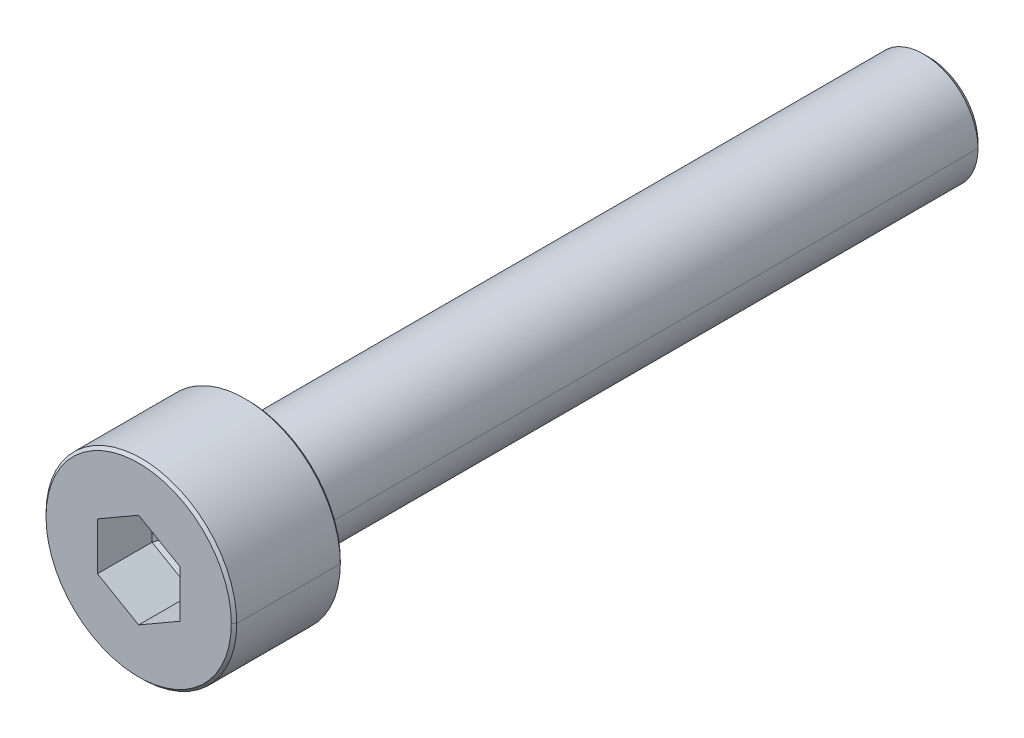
ISO-10303-21;
HEADER;
FILE_DESCRIPTION(('STEP AP214'),'2;1');
FILE_NAME('part.step','',(''),(''),'','','');
FILE_SCHEMA(('AUTOMOTIVE_DESIGN { 1 0 10303 214 1 1 1 1 }'));
ENDSEC;
DATA;
#1=APPLICATION_CONTEXT('core data for automotive mechanical design processes');
#2=APPLICATION_PROTOCOL_DEFINITION('international standard','automotive_design',2000,#1);
#3=PRODUCT_CONTEXT('',#1,'mechanical');
#4=PRODUCT('Part','Part','',(#3));
#5=PRODUCT_RELATED_PRODUCT_CATEGORY('part','',(#4));
#6=PRODUCT_DEFINITION_FORMATION('','',#4);
#7=PRODUCT_DEFINITION_CONTEXT('part definition',#1,'design');
#8=PRODUCT_DEFINITION('design','',#6,#7);
#9=PRODUCT_DEFINITION_SHAPE('','',#8);
#10=(LENGTH_UNIT() NAMED_UNIT(*) SI_UNIT(.MILLI.,.METRE.));
#11=(NAMED_UNIT(*) PLANE_ANGLE_UNIT() SI_UNIT($,.RADIAN.));
#12=(NAMED_UNIT(*) SI_UNIT($,.STERADIAN.) SOLID_ANGLE_UNIT());
#13=UNCERTAINTY_MEASURE_WITH_UNIT(LENGTH_MEASURE(1.E-05),#10,'distance_accuracy_value','');
#14=(GEOMETRIC_REPRESENTATION_CONTEXT(3) GLOBAL_UNCERTAINTY_ASSIGNED_CONTEXT((#13)) GLOBAL_UNIT_ASSIGNED_CONTEXT((#10,
#11,#12)) REPRESENTATION_CONTEXT('',''));
#15=CARTESIAN_POINT('',(0.,0.,0.));
#16=DIRECTION('',(0.,0.,1.));
#17=DIRECTION('',(1.,0.,0.));
#18=AXIS2_PLACEMENT_3D('',#15,#16,#17);
#19=CARTESIAN_POINT('',(0.,0.,25.));
#20=DIRECTION('',(0.,0.,1.));
#21=DIRECTION('',(1.,0.,0.));
#22=AXIS2_PLACEMENT_3D('',#19,#20,#21);
#23=CYLINDRICAL_SURFACE('',#22,3.5);
#24=DIRECTION('',(0.,0.,1.));
#25=VECTOR('',#24,1.);
#26=CARTESIAN_POINT('',(3.499997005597,1.366616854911E-09,25.1000029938));
#27=LINE('',#26,#25);
#28=CARTESIAN_POINT('',(3.5,0.,25.10000246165));
#29=VERTEX_POINT('',#28);
#30=CARTESIAN_POINT('',(3.5,0.,28.89999753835));
#31=VERTEX_POINT('',#30);
#32=EDGE_CURVE('E487',#29,#31,#27,.T.);
#33=ORIENTED_EDGE('',*,*,#32,.F.);
#34=CARTESIAN_POINT('',(0.,0.,25.10000246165));
#35=DIRECTION('',(0.,0.,-1.));
#36=DIRECTION('',(-1.,0.,0.));
#37=AXIS2_PLACEMENT_3D('',#34,#35,#36);
#38=CIRCLE('',#37,3.5);
#39=CARTESIAN_POINT('',(-3.5,0.,25.10000246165));
#40=VERTEX_POINT('',#39);
#41=EDGE_CURVE('E447',#40,#29,#38,.T.);
#42=ORIENTED_EDGE('',*,*,#41,.F.);
#43=DIRECTION('',(0.,0.,1.));
#44=VECTOR('',#43,1.);
#45=CARTESIAN_POINT('',(-3.499997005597,-1.366617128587E-09,25.1000029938));
#46=LINE('',#45,#44);
#47=CARTESIAN_POINT('',(-3.5,0.,28.89999753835));
#48=VERTEX_POINT('',#47);
#49=EDGE_CURVE('E233',#40,#48,#46,.T.);
#50=ORIENTED_EDGE('',*,*,#49,.T.);
#51=CARTESIAN_POINT('',(0.,0.,28.89999753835));
#52=DIRECTION('',(0.,0.,1.));
#53=DIRECTION('',(1.,0.,0.));
#54=AXIS2_PLACEMENT_3D('',#51,#52,#53);
#55=CIRCLE('',#54,3.5);
#56=EDGE_CURVE('E10',#31,#48,#55,.T.);
#57=ORIENTED_EDGE('',*,*,#56,.F.);
#58=EDGE_LOOP('',(#33,#42,#50,#57));
#59=FACE_BOUND('',#58,.T.);
#60=ADVANCED_FACE('F16',(#59),#23,.T.);
#61=CARTESIAN_POINT('',(0.,0.,28.94999384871));
#62=DIRECTION('',(0.,0.,-1.));
#63=DIRECTION('',(0.,-1.,0.));
#64=AXIS2_PLACEMENT_3D('',#61,#62,#63);
#65=CONICAL_SURFACE('',#64,3.449994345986,0.785396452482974);
#66=DIRECTION('',(0.707113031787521,-2.85301984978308E-09,-0.707100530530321));
#67=VECTOR('',#66,1.);
#68=CARTESIAN_POINT('',(3.399996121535,1.770094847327E-09,28.99999612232));
#69=LINE('',#68,#67);
#70=CARTESIAN_POINT('',(3.399993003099,0.,28.99999536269));
#71=VERTEX_POINT('',#70);
#72=EDGE_CURVE('E496',#71,#31,#69,.T.);
#73=ORIENTED_EDGE('',*,*,#72,.T.);
#74=ORIENTED_EDGE('',*,*,#56,.T.);
#75=DIRECTION('',(-0.707113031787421,2.85301614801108E-09,-0.707100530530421));
#76=VECTOR('',#75,1.);
#77=CARTESIAN_POINT('',(-3.399996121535,-1.770094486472E-09,28.99999612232));
#78=LINE('',#77,#76);
#79=CARTESIAN_POINT('',(-3.399993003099,0.,28.99999536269));
#80=VERTEX_POINT('',#79);
#81=EDGE_CURVE('E506',#80,#48,#78,.T.);
#82=ORIENTED_EDGE('',*,*,#81,.F.);
#83=CARTESIAN_POINT('',(0.,0.,28.99999536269));
#84=DIRECTION('',(0.,0.,1.));
#85=DIRECTION('',(1.,0.,0.));
#86=AXIS2_PLACEMENT_3D('',#83,#84,#85);
#87=CIRCLE('',#86,3.399993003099);
#88=EDGE_CURVE('E455',#71,#80,#87,.T.);
#89=ORIENTED_EDGE('',*,*,#88,.F.);
#90=EDGE_LOOP('',(#73,#74,#82,#89));
#91=FACE_BOUND('',#90,.T.);
#92=ADVANCED_FACE('F397',(#91),#65,.T.);
#93=CARTESIAN_POINT('',(0.,0.,26.));
#94=DIRECTION('',(0.,0.,1.));
#95=DIRECTION('',(1.,0.,0.));
#96=AXIS2_PLACEMENT_3D('',#93,#94,#95);
#97=PLANE('',#96);
#98=DIRECTION('',(-0.866025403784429,0.500000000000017,0.));
#99=VECTOR('',#98,1.);
#100=CARTESIAN_POINT('',(0.08660254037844,0.05,26.));
#101=LINE('',#100,#99);
#102=CARTESIAN_POINT('',(0.08660254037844,0.05,26.));
#103=VERTEX_POINT('',#102);
#104=CARTESIAN_POINT('',(0.,0.1,26.));
#105=VERTEX_POINT('',#104);
#106=EDGE_CURVE('E186',#103,#105,#101,.T.);
#107=ORIENTED_EDGE('',*,*,#106,.T.);
#108=DIRECTION('',(-0.866025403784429,-0.500000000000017,0.));
#109=VECTOR('',#108,1.);
#110=CARTESIAN_POINT('',(0.,0.1,26.));
#111=LINE('',#110,#109);
#112=CARTESIAN_POINT('',(-0.08660254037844,0.05,26.));
#113=VERTEX_POINT('',#112);
#114=EDGE_CURVE('E184',#105,#113,#111,.T.);
#115=ORIENTED_EDGE('',*,*,#114,.T.);
#116=DIRECTION('',(0.,-1.,0.));
#117=VECTOR('',#116,1.);
#118=CARTESIAN_POINT('',(-0.08660254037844,0.05,26.));
#119=LINE('',#118,#117);
#120=CARTESIAN_POINT('',(-0.08660254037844,-0.05,26.));
#121=VERTEX_POINT('',#120);
#122=EDGE_CURVE('E43',#113,#121,#119,.T.);
#123=ORIENTED_EDGE('',*,*,#122,.T.);
#124=DIRECTION('',(0.866025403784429,-0.500000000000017,0.));
#125=VECTOR('',#124,1.);
#126=CARTESIAN_POINT('',(-0.08660254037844,-0.05,26.));
#127=LINE('',#126,#125);
#128=CARTESIAN_POINT('',(0.,-0.1,26.));
#129=VERTEX_POINT('',#128);
#130=EDGE_CURVE('E224',#121,#129,#127,.T.);
#131=ORIENTED_EDGE('',*,*,#130,.T.);
#132=DIRECTION('',(0.866025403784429,0.500000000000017,0.));
#133=VECTOR('',#132,1.);
#134=CARTESIAN_POINT('',(0.,-0.1,26.));
#135=LINE('',#134,#133);
#136=CARTESIAN_POINT('',(0.08660254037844,-0.05,26.));
#137=VERTEX_POINT('',#136);
#138=EDGE_CURVE('E219',#129,#137,#135,.T.);
#139=ORIENTED_EDGE('',*,*,#138,.T.);
#140=DIRECTION('',(0.,1.,0.));
#141=VECTOR('',#140,1.);
#142=CARTESIAN_POINT('',(0.08660254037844,-0.05,26.));
#143=LINE('',#142,#141);
#144=EDGE_CURVE('E469',#137,#103,#143,.T.);
#145=ORIENTED_EDGE('',*,*,#144,.T.);
#146=EDGE_LOOP('',(#107,#115,#123,#131,#139,#145));
#147=FACE_BOUND('',#146,.T.);
#148=ADVANCED_FACE('F305',(#147),#97,.T.);
#149=CARTESIAN_POINT('',(-1.51,0.8717989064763,29.));
#150=DIRECTION('',(-1.,0.,0.));
#151=DIRECTION('',(0.,0.,1.));
#152=AXIS2_PLACEMENT_3D('',#149,#150,#151);
#153=PLANE('',#152);
#154=DIRECTION('',(0.,0.,-1.));
#155=VECTOR('',#154,1.);
#156=CARTESIAN_POINT('',(-1.51,0.8717989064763,29.));
#157=LINE('',#156,#155);
#158=CARTESIAN_POINT('',(-1.51,0.8717989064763,29.));
#159=VERTEX_POINT('',#158);
#160=CARTESIAN_POINT('',(-1.51,0.8717989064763,27.));
#161=VERTEX_POINT('',#160);
#162=EDGE_CURVE('E193',#159,#161,#157,.T.);
#163=ORIENTED_EDGE('',*,*,#162,.F.);
#164=DIRECTION('',(0.,-1.,0.));
#165=VECTOR('',#164,1.);
#166=CARTESIAN_POINT('',(-1.51,0.8717989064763,29.));
#167=LINE('',#166,#165);
#168=CARTESIAN_POINT('',(-1.51,-0.8717989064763,29.));
#169=VERTEX_POINT('',#168);
#170=EDGE_CURVE('E210',#159,#169,#167,.T.);
#171=ORIENTED_EDGE('',*,*,#170,.T.);
#172=DIRECTION('',(0.,0.,-1.));
#173=VECTOR('',#172,1.);
#174=CARTESIAN_POINT('',(-1.51,-0.8717989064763,29.));
#175=LINE('',#174,#173);
#176=CARTESIAN_POINT('',(-1.51,-0.8717989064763,27.));
#177=VERTEX_POINT('',#176);
#178=EDGE_CURVE('E451',#169,#177,#175,.T.);
#179=ORIENTED_EDGE('',*,*,#178,.T.);
#180=DIRECTION('',(0.,-1.,0.));
#181=VECTOR('',#180,1.);
#182=CARTESIAN_POINT('',(-1.51,0.8717989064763,27.));
#183=LINE('',#182,#181);
#184=EDGE_CURVE('E29',#161,#177,#183,.T.);
#185=ORIENTED_EDGE('',*,*,#184,.F.);
#186=EDGE_LOOP('',(#163,#171,#179,#185));
#187=FACE_BOUND('',#186,.T.);
#188=ADVANCED_FACE('F262',(#187),#153,.F.);
#189=CARTESIAN_POINT('',(-0.7983012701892,0.,26.5));
#190=DIRECTION('',(-0.574858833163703,0.,-0.818252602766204));
#191=DIRECTION('',(-0.818252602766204,0.,0.574858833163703));
#192=AXIS2_PLACEMENT_3D('',#189,#190,#191);
#193=PLANE('',#192);
#194=DIRECTION('',(-0.73984776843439,-0.427151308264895,0.519775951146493));
#195=VECTOR('',#194,1.);
#196=CARTESIAN_POINT('',(-0.08660254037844,-0.05,26.));
#197=LINE('',#196,#195);
#198=EDGE_CURVE('E227',#121,#177,#197,.T.);
#199=ORIENTED_EDGE('',*,*,#198,.F.);
#200=ORIENTED_EDGE('',*,*,#122,.F.);
#201=DIRECTION('',(-0.73984776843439,0.427151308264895,0.519775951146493));
#202=VECTOR('',#201,1.);
#203=CARTESIAN_POINT('',(-0.08660254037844,0.05,26.));
#204=LINE('',#203,#202);
#205=EDGE_CURVE('E195',#113,#161,#204,.T.);
#206=ORIENTED_EDGE('',*,*,#205,.T.);
#207=ORIENTED_EDGE('',*,*,#184,.T.);
#208=EDGE_LOOP('',(#199,#200,#206,#207));
#209=FACE_BOUND('',#208,.T.);
#210=ADVANCED_FACE('F384',(#209),#193,.F.);
#211=CARTESIAN_POINT('',(-0.3991506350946,-0.6913491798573,26.5));
#212=DIRECTION('',(-0.287429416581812,-0.49784235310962,-0.818252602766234));
#213=DIRECTION('',(0.,-0.854302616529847,0.519775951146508));
#214=AXIS2_PLACEMENT_3D('',#211,#212,#213);
#215=PLANE('',#214);
#216=DIRECTION('',(0.,-0.854302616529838,0.519775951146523));
#217=VECTOR('',#216,1.);
#218=CARTESIAN_POINT('',(0.,-0.1,26.));
#219=LINE('',#218,#217);
#220=CARTESIAN_POINT('',(0.,-1.743597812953,27.));
#221=VERTEX_POINT('',#220);
#222=EDGE_CURVE('E222',#129,#221,#219,.T.);
#223=ORIENTED_EDGE('',*,*,#222,.F.);
#224=ORIENTED_EDGE('',*,*,#130,.F.);
#225=ORIENTED_EDGE('',*,*,#198,.T.);
#226=DIRECTION('',(0.866025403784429,-0.500000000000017,0.));
#227=VECTOR('',#226,1.);
#228=CARTESIAN_POINT('',(-1.51,-0.8717989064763,27.));
#229=LINE('',#228,#227);
#230=EDGE_CURVE('E228',#177,#221,#229,.T.);
#231=ORIENTED_EDGE('',*,*,#230,.T.);
#232=EDGE_LOOP('',(#223,#224,#225,#231));
#233=FACE_BOUND('',#232,.T.);
#234=ADVANCED_FACE('F380',(#233),#215,.F.);
#235=CARTESIAN_POINT('',(-1.51,-0.8717989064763,29.));
#236=DIRECTION('',(-0.500000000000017,-0.866025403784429,0.));
#237=DIRECTION('',(-0.866025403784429,0.500000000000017,0.));
#238=AXIS2_PLACEMENT_3D('',#235,#236,#237);
#239=PLANE('',#238);
#240=ORIENTED_EDGE('',*,*,#178,.F.);
#241=DIRECTION('',(0.866025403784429,-0.500000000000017,0.));
#242=VECTOR('',#241,1.);
#243=CARTESIAN_POINT('',(-1.51,-0.8717989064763,29.));
#244=LINE('',#243,#242);
#245=CARTESIAN_POINT('',(0.,-1.743597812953,29.));
#246=VERTEX_POINT('',#245);
#247=EDGE_CURVE('E238',#169,#246,#244,.T.);
#248=ORIENTED_EDGE('',*,*,#247,.T.);
#249=DIRECTION('',(0.,0.,-1.));
#250=VECTOR('',#249,1.);
#251=CARTESIAN_POINT('',(0.,-1.743597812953,29.));
#252=LINE('',#251,#250);
#253=EDGE_CURVE('E454',#246,#221,#252,.T.);
#254=ORIENTED_EDGE('',*,*,#253,.T.);
#255=ORIENTED_EDGE('',*,*,#230,.F.);
#256=EDGE_LOOP('',(#240,#248,#254,#255));
#257=FACE_BOUND('',#256,.T.);
#258=ADVANCED_FACE('F377',(#257),#239,.F.);
#259=CARTESIAN_POINT('',(0.,-1.743597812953,29.));
#260=DIRECTION('',(0.500000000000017,-0.866025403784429,0.));
#261=DIRECTION('',(0.,0.,-1.));
#262=AXIS2_PLACEMENT_3D('',#259,#260,#261);
#263=PLANE('',#262);
#264=ORIENTED_EDGE('',*,*,#253,.F.);
#265=DIRECTION('',(0.866025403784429,0.500000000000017,0.));
#266=VECTOR('',#265,1.);
#267=CARTESIAN_POINT('',(0.,-1.743597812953,29.));
#268=LINE('',#267,#266);
#269=CARTESIAN_POINT('',(1.51,-0.8717989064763,29.));
#270=VERTEX_POINT('',#269);
#271=EDGE_CURVE('E214',#246,#270,#268,.T.);
#272=ORIENTED_EDGE('',*,*,#271,.T.);
#273=DIRECTION('',(0.,0.,-1.));
#274=VECTOR('',#273,1.);
#275=CARTESIAN_POINT('',(1.51,-0.8717989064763,29.));
#276=LINE('',#275,#274);
#277=CARTESIAN_POINT('',(1.51,-0.8717989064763,27.));
#278=VERTEX_POINT('',#277);
#279=EDGE_CURVE('E470',#270,#278,#276,.T.);
#280=ORIENTED_EDGE('',*,*,#279,.T.);
#281=DIRECTION('',(0.866025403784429,0.500000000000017,0.));
#282=VECTOR('',#281,1.);
#283=CARTESIAN_POINT('',(0.,-1.743597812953,27.));
#284=LINE('',#283,#282);
#285=EDGE_CURVE('E482',#221,#278,#284,.T.);
#286=ORIENTED_EDGE('',*,*,#285,.F.);
#287=EDGE_LOOP('',(#264,#272,#280,#286));
#288=FACE_BOUND('',#287,.T.);
#289=ADVANCED_FACE('F375',(#288),#263,.F.);
#290=CARTESIAN_POINT('',(0.3991506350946,-0.6913491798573,26.5));
#291=DIRECTION('',(0.287429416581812,-0.49784235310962,-0.818252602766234));
#292=DIRECTION('',(0.,-0.854302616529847,0.519775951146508));
#293=AXIS2_PLACEMENT_3D('',#290,#291,#292);
#294=PLANE('',#293);
#295=DIRECTION('',(0.73984776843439,-0.427151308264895,0.519775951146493));
#296=VECTOR('',#295,1.);
#297=CARTESIAN_POINT('',(0.08660254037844,-0.05,26.));
#298=LINE('',#297,#296);
#299=EDGE_CURVE('E223',#137,#278,#298,.T.);
#300=ORIENTED_EDGE('',*,*,#299,.F.);
#301=ORIENTED_EDGE('',*,*,#138,.F.);
#302=ORIENTED_EDGE('',*,*,#222,.T.);
#303=ORIENTED_EDGE('',*,*,#285,.T.);
#304=EDGE_LOOP('',(#300,#301,#302,#303));
#305=FACE_BOUND('',#304,.T.);
#306=ADVANCED_FACE('F372',(#305),#294,.F.);
#307=CARTESIAN_POINT('',(0.7983012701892,0.,26.5));
#308=DIRECTION('',(0.574858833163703,0.,-0.818252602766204));
#309=DIRECTION('',(0.,-1.,0.));
#310=AXIS2_PLACEMENT_3D('',#307,#308,#309);
#311=PLANE('',#310);
#312=DIRECTION('',(0.73984776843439,0.427151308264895,0.519775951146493));
#313=VECTOR('',#312,1.);
#314=CARTESIAN_POINT('',(0.08660254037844,0.05,26.));
#315=LINE('',#314,#313);
#316=CARTESIAN_POINT('',(1.51,0.8717989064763,27.));
#317=VERTEX_POINT('',#316);
#318=EDGE_CURVE('E171',#103,#317,#315,.T.);
#319=ORIENTED_EDGE('',*,*,#318,.F.);
#320=ORIENTED_EDGE('',*,*,#144,.F.);
#321=ORIENTED_EDGE('',*,*,#299,.T.);
#322=DIRECTION('',(0.,1.,0.));
#323=VECTOR('',#322,1.);
#324=CARTESIAN_POINT('',(1.51,-0.8717989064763,27.));
#325=LINE('',#324,#323);
#326=EDGE_CURVE('E466',#278,#317,#325,.T.);
#327=ORIENTED_EDGE('',*,*,#326,.T.);
#328=EDGE_LOOP('',(#319,#320,#321,#327));
#329=FACE_BOUND('',#328,.T.);
#330=ADVANCED_FACE('F358',(#329),#311,.F.);
#331=CARTESIAN_POINT('',(1.51,-0.8717989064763,29.));
#332=DIRECTION('',(1.,0.,0.));
#333=DIRECTION('',(0.,1.,0.));
#334=AXIS2_PLACEMENT_3D('',#331,#332,#333);
#335=PLANE('',#334);
#336=ORIENTED_EDGE('',*,*,#279,.F.);
#337=DIRECTION('',(0.,1.,0.));
#338=VECTOR('',#337,1.);
#339=CARTESIAN_POINT('',(1.51,-0.8717989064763,29.));
#340=LINE('',#339,#338);
#341=CARTESIAN_POINT('',(1.51,0.8717989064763,29.));
#342=VERTEX_POINT('',#341);
#343=EDGE_CURVE('E461',#270,#342,#340,.T.);
#344=ORIENTED_EDGE('',*,*,#343,.T.);
#345=DIRECTION('',(0.,0.,-1.));
#346=VECTOR('',#345,1.);
#347=CARTESIAN_POINT('',(1.51,0.8717989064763,29.));
#348=LINE('',#347,#346);
#349=EDGE_CURVE('E175',#342,#317,#348,.T.);
#350=ORIENTED_EDGE('',*,*,#349,.T.);
#351=ORIENTED_EDGE('',*,*,#326,.F.);
#352=EDGE_LOOP('',(#336,#344,#350,#351));
#353=FACE_BOUND('',#352,.T.);
#354=ADVANCED_FACE('F388',(#353),#335,.F.);
#355=CARTESIAN_POINT('',(1.51,0.8717989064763,29.));
#356=DIRECTION('',(0.500000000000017,0.866025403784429,0.));
#357=DIRECTION('',(0.,0.,-1.));
#358=AXIS2_PLACEMENT_3D('',#355,#356,#357);
#359=PLANE('',#358);
#360=ORIENTED_EDGE('',*,*,#349,.F.);
#361=DIRECTION('',(-0.866025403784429,0.500000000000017,0.));
#362=VECTOR('',#361,1.);
#363=CARTESIAN_POINT('',(1.51,0.8717989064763,29.));
#364=LINE('',#363,#362);
#365=CARTESIAN_POINT('',(0.,1.743597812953,29.));
#366=VERTEX_POINT('',#365);
#367=EDGE_CURVE('E200',#342,#366,#364,.T.);
#368=ORIENTED_EDGE('',*,*,#367,.T.);
#369=DIRECTION('',(0.,0.,-1.));
#370=VECTOR('',#369,1.);
#371=CARTESIAN_POINT('',(0.,1.743597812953,29.));
#372=LINE('',#371,#370);
#373=CARTESIAN_POINT('',(0.,1.743597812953,27.));
#374=VERTEX_POINT('',#373);
#375=EDGE_CURVE('E191',#366,#374,#372,.T.);
#376=ORIENTED_EDGE('',*,*,#375,.T.);
#377=DIRECTION('',(-0.866025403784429,0.500000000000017,0.));
#378=VECTOR('',#377,1.);
#379=CARTESIAN_POINT('',(1.51,0.8717989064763,27.));
#380=LINE('',#379,#378);
#381=EDGE_CURVE('E164',#317,#374,#380,.T.);
#382=ORIENTED_EDGE('',*,*,#381,.F.);
#383=EDGE_LOOP('',(#360,#368,#376,#382));
#384=FACE_BOUND('',#383,.T.);
#385=ADVANCED_FACE('F198',(#384),#359,.F.);
#386=CARTESIAN_POINT('',(0.3991506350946,0.6913491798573,26.5));
#387=DIRECTION('',(0.287429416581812,0.49784235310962,-0.818252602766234));
#388=DIRECTION('',(-0.943483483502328,0.,-0.331419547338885));
#389=AXIS2_PLACEMENT_3D('',#386,#387,#388);
#390=PLANE('',#389);
#391=DIRECTION('',(0.,0.854302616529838,0.519775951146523));
#392=VECTOR('',#391,1.);
#393=CARTESIAN_POINT('',(0.,0.1,26.));
#394=LINE('',#393,#392);
#395=EDGE_CURVE('E168',#105,#374,#394,.T.);
#396=ORIENTED_EDGE('',*,*,#395,.F.);
#397=ORIENTED_EDGE('',*,*,#106,.F.);
#398=ORIENTED_EDGE('',*,*,#318,.T.);
#399=ORIENTED_EDGE('',*,*,#381,.T.);
#400=EDGE_LOOP('',(#396,#397,#398,#399));
#401=FACE_BOUND('',#400,.T.);
#402=ADVANCED_FACE('F166',(#401),#390,.F.);
#403=CARTESIAN_POINT('',(-0.3991506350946,0.6913491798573,26.5));
#404=DIRECTION('',(-0.287429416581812,0.49784235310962,-0.818252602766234));
#405=DIRECTION('',(-0.943483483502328,0.,0.331419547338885));
#406=AXIS2_PLACEMENT_3D('',#403,#404,#405);
#407=PLANE('',#406);
#408=ORIENTED_EDGE('',*,*,#205,.F.);
#409=ORIENTED_EDGE('',*,*,#114,.F.);
#410=ORIENTED_EDGE('',*,*,#395,.T.);
#411=DIRECTION('',(-0.866025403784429,-0.500000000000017,0.));
#412=VECTOR('',#411,1.);
#413=CARTESIAN_POINT('',(0.,1.743597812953,27.));
#414=LINE('',#413,#412);
#415=EDGE_CURVE('E182',#374,#161,#414,.T.);
#416=ORIENTED_EDGE('',*,*,#415,.T.);
#417=EDGE_LOOP('',(#408,#409,#410,#416));
#418=FACE_BOUND('',#417,.T.);
#419=ADVANCED_FACE('F181',(#418),#407,.F.);
#420=CARTESIAN_POINT('',(0.,1.743597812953,29.));
#421=DIRECTION('',(-0.500000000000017,0.866025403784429,0.));
#422=DIRECTION('',(0.,0.,1.));
#423=AXIS2_PLACEMENT_3D('',#420,#421,#422);
#424=PLANE('',#423);
#425=ORIENTED_EDGE('',*,*,#375,.F.);
#426=DIRECTION('',(-0.866025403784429,-0.500000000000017,0.));
#427=VECTOR('',#426,1.);
#428=CARTESIAN_POINT('',(0.,1.743597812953,29.));
#429=LINE('',#428,#427);
#430=EDGE_CURVE('E202',#366,#159,#429,.T.);
#431=ORIENTED_EDGE('',*,*,#430,.T.);
#432=ORIENTED_EDGE('',*,*,#162,.T.);
#433=ORIENTED_EDGE('',*,*,#415,.F.);
#434=EDGE_LOOP('',(#425,#431,#432,#433));
#435=FACE_BOUND('',#434,.T.);
#436=ADVANCED_FACE('F189',(#435),#424,.F.);
#437=CARTESIAN_POINT('',(0.,0.,29.));
#438=DIRECTION('',(0.,0.,1.));
#439=DIRECTION('',(1.,0.,0.));
#440=AXIS2_PLACEMENT_3D('',#437,#438,#439);
#441=PLANE('',#440);
#442=ORIENTED_EDGE('',*,*,#367,.F.);
#443=ORIENTED_EDGE('',*,*,#343,.F.);
#444=ORIENTED_EDGE('',*,*,#271,.F.);
#445=ORIENTED_EDGE('',*,*,#247,.F.);
#446=ORIENTED_EDGE('',*,*,#170,.F.);
#447=ORIENTED_EDGE('',*,*,#430,.F.);
#448=EDGE_LOOP('',(#442,#443,#444,#445,#446,#447));
#449=FACE_BOUND('',#448,.T.);
#450=CARTESIAN_POINT('',(0.,0.,28.99999536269));
#451=DIRECTION('',(0.,0.,1.));
#452=DIRECTION('',(-1.,0.,0.));
#453=AXIS2_PLACEMENT_3D('',#450,#451,#452);
#454=CIRCLE('',#453,3.399993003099);
#455=EDGE_CURVE('E457',#80,#71,#454,.T.);
#456=ORIENTED_EDGE('',*,*,#455,.T.);
#457=ORIENTED_EDGE('',*,*,#88,.T.);
#458=EDGE_LOOP('',(#456,#457));
#459=FACE_BOUND('',#458,.T.);
#460=ADVANCED_FACE('F543',(#449,#459),#441,.T.);
#461=CARTESIAN_POINT('',(0.,0.,28.94999384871));
#462=DIRECTION('',(0.,0.,-1.));
#463=DIRECTION('',(0.,-1.,0.));
#464=AXIS2_PLACEMENT_3D('',#461,#462,#463);
#465=CONICAL_SURFACE('',#464,3.449994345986,0.785396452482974);
#466=ORIENTED_EDGE('',*,*,#81,.T.);
#467=CARTESIAN_POINT('',(0.,0.,28.89999753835));
#468=DIRECTION('',(0.,0.,1.));
#469=DIRECTION('',(-1.,0.,0.));
#470=AXIS2_PLACEMENT_3D('',#467,#468,#469);
#471=CIRCLE('',#470,3.5);
#472=EDGE_CURVE('E491',#48,#31,#471,.T.);
#473=ORIENTED_EDGE('',*,*,#472,.T.);
#474=ORIENTED_EDGE('',*,*,#72,.F.);
#475=ORIENTED_EDGE('',*,*,#455,.F.);
#476=EDGE_LOOP('',(#466,#473,#474,#475));
#477=FACE_BOUND('',#476,.T.);
#478=ADVANCED_FACE('F271',(#477),#465,.T.);
#479=CARTESIAN_POINT('',(0.,0.,25.));
#480=DIRECTION('',(0.,0.,1.));
#481=DIRECTION('',(1.,0.,0.));
#482=AXIS2_PLACEMENT_3D('',#479,#480,#481);
#483=CYLINDRICAL_SURFACE('',#482,3.5);
#484=ORIENTED_EDGE('',*,*,#49,.F.);
#485=CARTESIAN_POINT('',(0.,0.,25.10000246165));
#486=DIRECTION('',(0.,0.,-1.));
#487=DIRECTION('',(1.,0.,0.));
#488=AXIS2_PLACEMENT_3D('',#485,#486,#487);
#489=CIRCLE('',#488,3.5);
#490=EDGE_CURVE('E229',#29,#40,#489,.T.);
#491=ORIENTED_EDGE('',*,*,#490,.F.);
#492=ORIENTED_EDGE('',*,*,#32,.T.);
#493=ORIENTED_EDGE('',*,*,#472,.F.);
#494=EDGE_LOOP('',(#484,#491,#492,#493));
#495=FACE_BOUND('',#494,.T.);
#496=ADVANCED_FACE('F18',(#495),#483,.T.);
#497=CARTESIAN_POINT('',(0.,0.,25.05000615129));
#498=DIRECTION('',(0.,0.,1.));
#499=DIRECTION('',(0.,-1.,0.));
#500=AXIS2_PLACEMENT_3D('',#497,#498,#499);
#501=CONICAL_SURFACE('',#500,3.449994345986,0.785396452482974);
#502=DIRECTION('',(0.707113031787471,-2.85302338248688E-09,0.707100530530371));
#503=VECTOR('',#502,1.);
#504=CARTESIAN_POINT('',(3.399996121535,1.770095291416E-09,25.00000387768));
#505=LINE('',#504,#503);
#506=CARTESIAN_POINT('',(3.399993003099,0.,25.00000463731));
#507=VERTEX_POINT('',#506);
#508=EDGE_CURVE('E234',#507,#29,#505,.T.);
#509=ORIENTED_EDGE('',*,*,#508,.T.);
#510=ORIENTED_EDGE('',*,*,#490,.T.);
#511=DIRECTION('',(-0.707113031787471,2.85301617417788E-09,0.707100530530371));
#512=VECTOR('',#511,1.);
#513=CARTESIAN_POINT('',(-3.399996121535,-1.770094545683E-09,25.00000387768));
#514=LINE('',#513,#512);
#515=CARTESIAN_POINT('',(-3.399993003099,0.,25.00000463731));
#516=VERTEX_POINT('',#515);
#517=EDGE_CURVE('E450',#516,#40,#514,.T.);
#518=ORIENTED_EDGE('',*,*,#517,.F.);
#519=CARTESIAN_POINT('',(0.,0.,25.00000463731));
#520=DIRECTION('',(0.,0.,-1.));
#521=DIRECTION('',(1.,0.,0.));
#522=AXIS2_PLACEMENT_3D('',#519,#520,#521);
#523=CIRCLE('',#522,3.399993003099);
#524=EDGE_CURVE('E438',#507,#516,#523,.T.);
#525=ORIENTED_EDGE('',*,*,#524,.F.);
#526=EDGE_LOOP('',(#509,#510,#518,#525));
#527=FACE_BOUND('',#526,.T.);
#528=ADVANCED_FACE('F359',(#527),#501,.T.);
#529=CARTESIAN_POINT('',(0.,0.,25.05000615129));
#530=DIRECTION('',(0.,0.,1.));
#531=DIRECTION('',(0.,-1.,0.));
#532=AXIS2_PLACEMENT_3D('',#529,#530,#531);
#533=CONICAL_SURFACE('',#532,3.449994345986,0.785396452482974);
#534=ORIENTED_EDGE('',*,*,#517,.T.);
#535=ORIENTED_EDGE('',*,*,#41,.T.);
#536=ORIENTED_EDGE('',*,*,#508,.F.);
#537=CARTESIAN_POINT('',(0.,0.,25.00000463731));
#538=DIRECTION('',(0.,0.,-1.));
#539=DIRECTION('',(-1.,0.,0.));
#540=AXIS2_PLACEMENT_3D('',#537,#538,#539);
#541=CIRCLE('',#540,3.399993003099);
#542=EDGE_CURVE('E465',#516,#507,#541,.T.);
#543=ORIENTED_EDGE('',*,*,#542,.F.);
#544=EDGE_LOOP('',(#534,#535,#536,#543));
#545=FACE_BOUND('',#544,.T.);
#546=ADVANCED_FACE('F370',(#545),#533,.T.);
#547=CARTESIAN_POINT('',(0.,0.,25.));
#548=DIRECTION('',(0.,0.,1.));
#549=DIRECTION('',(1.,0.,0.));
#550=AXIS2_PLACEMENT_3D('',#547,#548,#549);
#551=PLANE('',#550);
#552=CARTESIAN_POINT('',(0.,0.,25.));
#553=DIRECTION('',(0.,0.,1.));
#554=DIRECTION('',(-1.,0.,0.));
#555=AXIS2_PLACEMENT_3D('',#552,#553,#554);
#556=CIRCLE('',#555,2.);
#557=CARTESIAN_POINT('',(-2.,0.,25.));
#558=VERTEX_POINT('',#557);
#559=CARTESIAN_POINT('',(2.,0.,25.));
#560=VERTEX_POINT('',#559);
#561=EDGE_CURVE('E423',#558,#560,#556,.T.);
#562=ORIENTED_EDGE('',*,*,#561,.T.);
#563=CARTESIAN_POINT('',(0.,0.,25.));
#564=DIRECTION('',(0.,0.,1.));
#565=DIRECTION('',(1.,0.,0.));
#566=AXIS2_PLACEMENT_3D('',#563,#564,#565);
#567=CIRCLE('',#566,2.);
#568=EDGE_CURVE('E432',#560,#558,#567,.T.);
#569=ORIENTED_EDGE('',*,*,#568,.T.);
#570=EDGE_LOOP('',(#562,#569));
#571=FACE_BOUND('',#570,.T.);
#572=ORIENTED_EDGE('',*,*,#524,.T.);
#573=ORIENTED_EDGE('',*,*,#542,.T.);
#574=EDGE_LOOP('',(#572,#573));
#575=FACE_BOUND('',#574,.T.);
#576=ADVANCED_FACE('F269',(#571,#575),#551,.F.);
#577=CARTESIAN_POINT('',(0.,0.,0.));
#578=DIRECTION('',(0.,0.,1.));
#579=DIRECTION('',(1.,0.,0.));
#580=AXIS2_PLACEMENT_3D('',#577,#578,#579);
#581=CYLINDRICAL_SURFACE('',#580,2.);
#582=DIRECTION('',(-2.66013448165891E-07,-3.89114841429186E-11,0.999999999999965));
#583=VECTOR('',#582,1.);
#584=CARTESIAN_POINT('',(-1.999993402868,9.650047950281E-10,0.2000065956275));
#585=LINE('',#584,#583);
#586=CARTESIAN_POINT('',(-2.,0.,0.2000035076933));
#587=VERTEX_POINT('',#586);
#588=EDGE_CURVE('E429',#587,#558,#585,.T.);
#589=ORIENTED_EDGE('',*,*,#588,.T.);
#590=ORIENTED_EDGE('',*,*,#568,.F.);
#591=DIRECTION('',(2.66013448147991E-07,3.89114765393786E-11,0.999999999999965));
#592=VECTOR('',#591,1.);
#593=CARTESIAN_POINT('',(1.999993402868,-9.650046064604E-10,0.2000065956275));
#594=LINE('',#593,#592);
#595=CARTESIAN_POINT('',(2.,0.,0.2000035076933));
#596=VERTEX_POINT('',#595);
#597=EDGE_CURVE('E414',#596,#560,#594,.T.);
#598=ORIENTED_EDGE('',*,*,#597,.F.);
#599=CARTESIAN_POINT('',(0.,0.,0.2000035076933));
#600=DIRECTION('',(0.,0.,-1.));
#601=DIRECTION('',(-1.,0.,0.));
#602=AXIS2_PLACEMENT_3D('',#599,#600,#601);
#603=CIRCLE('',#602,1.99997712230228);
#604=EDGE_CURVE('E333',#587,#596,#603,.T.);
#605=ORIENTED_EDGE('',*,*,#604,.F.);
#606=EDGE_LOOP('',(#589,#590,#598,#605));
#607=FACE_BOUND('',#606,.T.);
#608=ADVANCED_FACE('F264',(#607),#581,.T.);
#609=CARTESIAN_POINT('',(0.,0.,0.));
#610=DIRECTION('',(0.,0.,1.));
#611=DIRECTION('',(1.,0.,0.));
#612=AXIS2_PLACEMENT_3D('',#609,#610,#611);
#613=CYLINDRICAL_SURFACE('',#612,2.);
#614=ORIENTED_EDGE('',*,*,#597,.T.);
#615=ORIENTED_EDGE('',*,*,#561,.F.);
#616=ORIENTED_EDGE('',*,*,#588,.F.);
#617=CARTESIAN_POINT('',(0.,0.,0.2000035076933));
#618=DIRECTION('',(0.,0.,-1.));
#619=DIRECTION('',(1.,0.,0.));
#620=AXIS2_PLACEMENT_3D('',#617,#618,#619);
#621=CIRCLE('',#620,1.99997712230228);
#622=EDGE_CURVE('E244',#596,#587,#621,.T.);
#623=ORIENTED_EDGE('',*,*,#622,.F.);
#624=EDGE_LOOP('',(#614,#615,#616,#623));
#625=FACE_BOUND('',#624,.T.);
#626=ADVANCED_FACE('F261',(#625),#613,.T.);
#627=CARTESIAN_POINT('',(0.,0.,0.1000133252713));
#628=DIRECTION('',(0.,0.,1.));
#629=DIRECTION('',(0.,-1.,0.));
#630=AXIS2_PLACEMENT_3D('',#627,#628,#629);
#631=CONICAL_SURFACE('',#630,1.899988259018,0.78539156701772);
#632=DIRECTION('',(0.707111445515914,6.82359991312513E-10,0.707102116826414));
#633=VECTOR('',#632,1.);
#634=CARTESIAN_POINT('',(1.799992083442,-1.158005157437E-09,7.914753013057E-06));
#635=LINE('',#634,#633);
#636=CARTESIAN_POINT('',(1.799986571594,0.,1.031853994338E-05));
#637=VERTEX_POINT('',#636);
#638=EDGE_CURVE('E320',#637,#596,#635,.T.);
#639=ORIENTED_EDGE('',*,*,#638,.T.);
#640=ORIENTED_EDGE('',*,*,#622,.T.);
#641=DIRECTION('',(-0.707111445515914,-6.82360761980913E-10,0.707102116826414));
#642=VECTOR('',#641,1.);
#643=CARTESIAN_POINT('',(-1.799992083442,1.158005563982E-09,7.914753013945E-06));
#644=LINE('',#643,#642);
#645=CARTESIAN_POINT('',(-1.799986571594,0.,1.031853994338E-05));
#646=VERTEX_POINT('',#645);
#647=EDGE_CURVE('E323',#646,#587,#644,.T.);
#648=ORIENTED_EDGE('',*,*,#647,.F.);
#649=CARTESIAN_POINT('',(1.799986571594,0.,0.));
#650=CARTESIAN_POINT('',(1.799986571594,-0.357753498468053,0.));
#651=CARTESIAN_POINT('',(1.66297075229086,-0.688825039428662,0.));
#652=CARTESIAN_POINT('',(1.52626634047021,-1.01914412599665,0.));
#653=CARTESIAN_POINT('',(1.27278271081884,-1.27278271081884,0.));
#654=CARTESIAN_POINT('',(1.02007666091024,-1.52564324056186,0.));
#655=CARTESIAN_POINT('',(0.688825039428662,-1.66297075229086,0.));
#656=CARTESIAN_POINT('',(0.358589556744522,-1.79987700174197,0.));
#657=CARTESIAN_POINT('',(0.,-1.799986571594,0.));
#658=CARTESIAN_POINT('',(-0.357489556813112,-1.80009580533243,0.));
#659=CARTESIAN_POINT('',(-0.688825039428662,-1.66297075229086,0.));
#660=CARTESIAN_POINT('',(-1.0191441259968,-1.52626634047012,0.));
#661=CARTESIAN_POINT('',(-1.27278271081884,-1.27278271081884,0.));
#662=CARTESIAN_POINT('',(-1.52564324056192,-1.02007666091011,0.));
#663=CARTESIAN_POINT('',(-1.66297075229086,-0.688825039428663,0.));
#664=CARTESIAN_POINT('',(-1.799986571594,-0.358325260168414,0.));
#665=CARTESIAN_POINT('',(-1.799986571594,0.,0.));
#666=B_SPLINE_CURVE_WITH_KNOTS('',2,(#649,#650,#651,#652,#653,#654,#655,#656,#657,#658,#659,
#660,#661,#662,#663,#664,#665),.UNSPECIFIED.,.F.,.F.,(3,2,2,2,2,2,2,2,3),(0.,0.125,0.25,0.375,
0.5,0.625,0.75,0.875,1.),.UNSPECIFIED.);
#667=EDGE_CURVE('E318',#637,#646,#666,.T.);
#668=ORIENTED_EDGE('',*,*,#667,.F.);
#669=EDGE_LOOP('',(#639,#640,#648,#668));
#670=FACE_BOUND('',#669,.T.);
#671=ADVANCED_FACE('F250',(#670),#631,.T.);
#672=CARTESIAN_POINT('',(0.,0.,0.1000133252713));
#673=DIRECTION('',(0.,0.,1.));
#674=DIRECTION('',(0.,-1.,0.));
#675=AXIS2_PLACEMENT_3D('',#672,#673,#674);
#676=CONICAL_SURFACE('',#675,1.899988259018,0.78539156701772);
#677=ORIENTED_EDGE('',*,*,#647,.T.);
#678=ORIENTED_EDGE('',*,*,#604,.T.);
#679=ORIENTED_EDGE('',*,*,#638,.F.);
#680=CARTESIAN_POINT('',(-1.799986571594,0.,0.));
#681=CARTESIAN_POINT('',(-1.799986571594,0.357753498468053,0.));
#682=CARTESIAN_POINT('',(-1.66297075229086,0.688825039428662,0.));
#683=CARTESIAN_POINT('',(-1.52626634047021,1.01914412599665,0.));
#684=CARTESIAN_POINT('',(-1.27278271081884,1.27278271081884,0.));
#685=CARTESIAN_POINT('',(-1.02007666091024,1.52564324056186,0.));
#686=CARTESIAN_POINT('',(-0.688825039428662,1.66297075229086,0.));
#687=CARTESIAN_POINT('',(-0.358589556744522,1.79987700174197,0.));
#688=CARTESIAN_POINT('',(0.,1.799986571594,0.));
#689=CARTESIAN_POINT('',(0.357489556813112,1.80009580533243,0.));
#690=CARTESIAN_POINT('',(0.688825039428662,1.66297075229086,0.));
#691=CARTESIAN_POINT('',(1.0191441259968,1.52626634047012,0.));
#692=CARTESIAN_POINT('',(1.27278271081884,1.27278271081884,0.));
#693=CARTESIAN_POINT('',(1.52564324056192,1.02007666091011,0.));
#694=CARTESIAN_POINT('',(1.66297075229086,0.688825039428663,0.));
#695=CARTESIAN_POINT('',(1.799986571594,0.358325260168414,0.));
#696=CARTESIAN_POINT('',(1.799986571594,0.,0.));
#697=B_SPLINE_CURVE_WITH_KNOTS('',2,(#680,#681,#682,#683,#684,#685,#686,#687,#688,#689,#690,
#691,#692,#693,#694,#695,#696),.UNSPECIFIED.,.F.,.F.,(3,2,2,2,2,2,2,2,3),(0.,0.125,0.25,0.375,
0.5,0.625,0.75,0.875,1.),.UNSPECIFIED.);
#698=EDGE_CURVE('E288',#646,#637,#697,.T.);
#699=ORIENTED_EDGE('',*,*,#698,.F.);
#700=EDGE_LOOP('',(#677,#678,#679,#699));
#701=FACE_BOUND('',#700,.T.);
#702=ADVANCED_FACE('F260',(#701),#676,.T.);
#703=CARTESIAN_POINT('',(0.,0.,0.));
#704=DIRECTION('',(0.,0.,1.));
#705=DIRECTION('',(1.,0.,0.));
#706=AXIS2_PLACEMENT_3D('',#703,#704,#705);
#707=PLANE('',#706);
#708=ORIENTED_EDGE('',*,*,#667,.T.);
#709=ORIENTED_EDGE('',*,*,#698,.T.);
#710=EDGE_LOOP('',(#708,#709));
#711=FACE_BOUND('',#710,.T.);
#712=ADVANCED_FACE('F295',(#711),#707,.F.);
#713=CLOSED_SHELL('',(#60,#92,#148,#188,#210,#234,#258,#289,#306,#330,#354,#385,#402,#419,#436,
#460,#478,#496,#528,#546,#576,#608,#626,#671,#702,#712));
#714=MANIFOLD_SOLID_BREP('B1',#713);
#715=ADVANCED_BREP_SHAPE_REPRESENTATION('',(#18,#714),#14);
#716=SHAPE_DEFINITION_REPRESENTATION(#9,#715);
ENDSEC;
END-ISO-10303-21;
